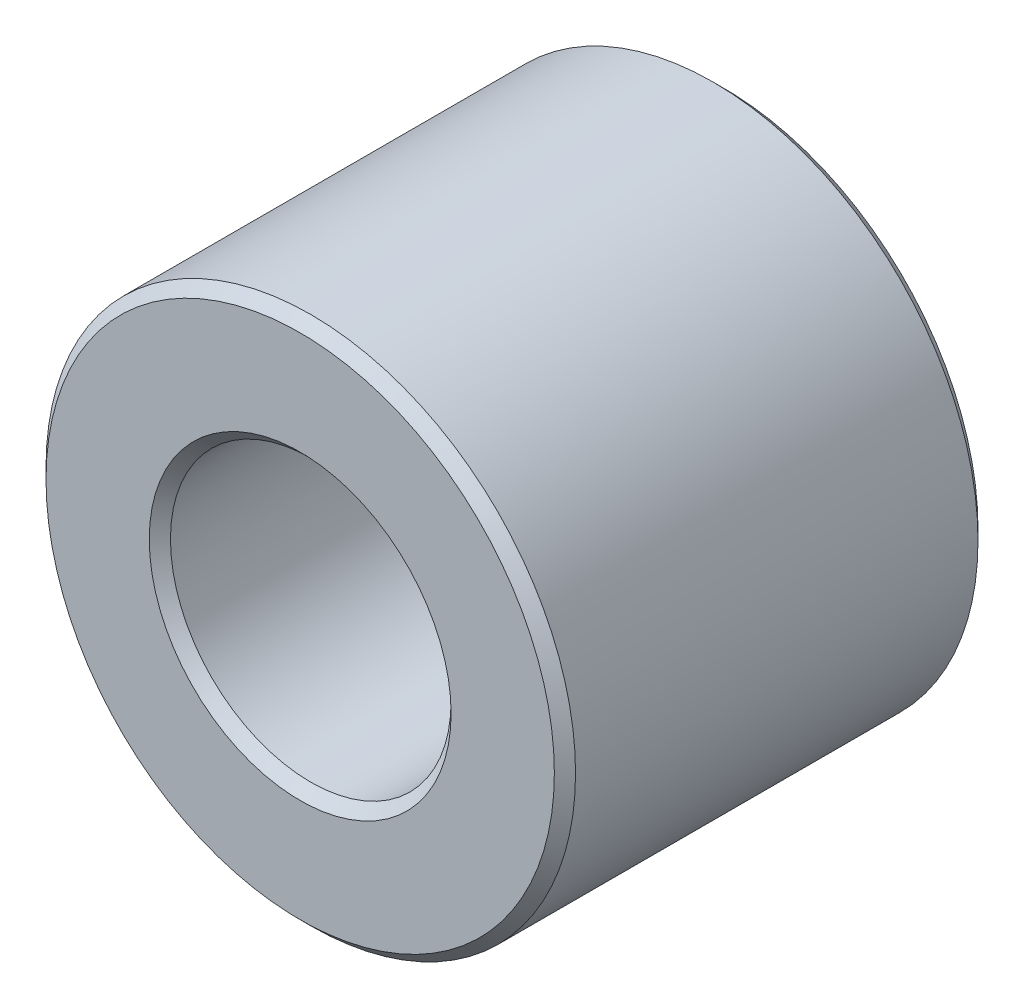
from build123d import *

# Parameters (mm, degrees)
SKETCH1_R           = 5
SKETCH1_R_2         = 2.65
BOSS_EXTRUDE2_DEPTH = 4
CHAMFER3_SIZE       = 0.2


with BuildPart() as part:
    # Sketch1 → Boss-Extrude2 (new, symmetric)
    with BuildSketch(Plane.XY):
        Circle(SKETCH1_R)
        Circle(SKETCH1_R_2, mode=Mode.SUBTRACT)
    extrude(amount=BOSS_EXTRUDE2_DEPTH, both=True)

    # Chamfer3
    chamfer3_edges = [part.edges().sort_by_distance(p)[0] for p in [
        (-5, 0, -4),
        (-5, 0, 4),
        (-2.65, 0, -4),
        (-2.65, 0, 4),
    ]]
    chamfer(chamfer3_edges, length=CHAMFER3_SIZE)


solid = part.part
